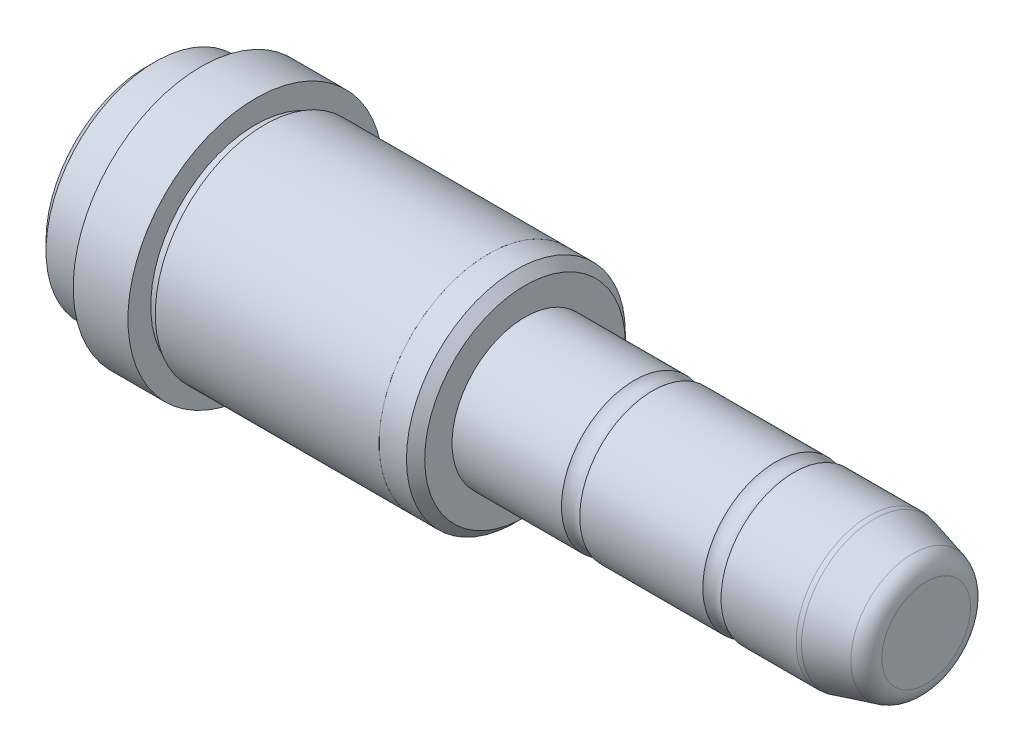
ISO-10303-21;
HEADER;
FILE_DESCRIPTION(('STEP AP214'),'2;1');
FILE_NAME('part.step','',(''),(''),'','','');
FILE_SCHEMA(('AUTOMOTIVE_DESIGN { 1 0 10303 214 1 1 1 1 }'));
ENDSEC;
DATA;
#1=APPLICATION_CONTEXT('core data for automotive mechanical design processes');
#2=APPLICATION_PROTOCOL_DEFINITION('international standard','automotive_design',2000,#1);
#3=PRODUCT_CONTEXT('',#1,'mechanical');
#4=PRODUCT('Part','Part','',(#3));
#5=PRODUCT_RELATED_PRODUCT_CATEGORY('part','',(#4));
#6=PRODUCT_DEFINITION_FORMATION('','',#4);
#7=PRODUCT_DEFINITION_CONTEXT('part definition',#1,'design');
#8=PRODUCT_DEFINITION('design','',#6,#7);
#9=PRODUCT_DEFINITION_SHAPE('','',#8);
#10=(LENGTH_UNIT() NAMED_UNIT(*) SI_UNIT(.MILLI.,.METRE.));
#11=(NAMED_UNIT(*) PLANE_ANGLE_UNIT() SI_UNIT($,.RADIAN.));
#12=(NAMED_UNIT(*) SI_UNIT($,.STERADIAN.) SOLID_ANGLE_UNIT());
#13=UNCERTAINTY_MEASURE_WITH_UNIT(LENGTH_MEASURE(1.E-05),#10,'distance_accuracy_value','');
#14=(GEOMETRIC_REPRESENTATION_CONTEXT(3) GLOBAL_UNCERTAINTY_ASSIGNED_CONTEXT((#13)) GLOBAL_UNIT_ASSIGNED_CONTEXT((#10,
#11,#12)) REPRESENTATION_CONTEXT('',''));
#15=CARTESIAN_POINT('',(0.,0.,0.));
#16=DIRECTION('',(0.,0.,1.));
#17=DIRECTION('',(1.,0.,0.));
#18=AXIS2_PLACEMENT_3D('',#15,#16,#17);
#19=CARTESIAN_POINT('',(85.55,2.42882543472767,0.));
#20=DIRECTION('',(1.,0.,0.));
#21=DIRECTION('',(0.,0.,-1.));
#22=AXIS2_PLACEMENT_3D('',#19,#20,#21);
#23=PLANE('',#22);
#24=CARTESIAN_POINT('',(85.55,0.,0.));
#25=DIRECTION('',(-1.,0.,0.));
#26=DIRECTION('',(0.,1.,0.));
#27=AXIS2_PLACEMENT_3D('',#24,#25,#26);
#28=CIRCLE('',#27,4.85765086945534);
#29=CARTESIAN_POINT('',(85.55,4.85765086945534,0.));
#30=VERTEX_POINT('',#29);
#31=EDGE_CURVE('E128',#30,#30,#28,.T.);
#32=ORIENTED_EDGE('',*,*,#31,.F.);
#33=EDGE_LOOP('',(#32));
#34=FACE_BOUND('',#33,.T.);
#35=ADVANCED_FACE('F15',(#34),#23,.T.);
#36=CARTESIAN_POINT('',(83.55,0.,0.));
#37=DIRECTION('',(1.,0.,0.));
#38=DIRECTION('',(0.,0.,-1.));
#39=AXIS2_PLACEMENT_3D('',#36,#37,#38);
#40=TOROIDAL_SURFACE('',#39,4.85765086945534,2.);
#41=CARTESIAN_POINT('',(84.0676380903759,0.,0.));
#42=DIRECTION('',(-1.,0.,0.));
#43=DIRECTION('',(0.,1.,0.));
#44=AXIS2_PLACEMENT_3D('',#41,#42,#43);
#45=CIRCLE('',#44,6.78950252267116);
#46=CARTESIAN_POINT('',(84.0676380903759,6.78950252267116,0.));
#47=VERTEX_POINT('',#46);
#48=EDGE_CURVE('E123',#47,#47,#45,.T.);
#49=ORIENTED_EDGE('',*,*,#48,.F.);
#50=EDGE_LOOP('',(#49));
#51=FACE_BOUND('',#50,.T.);
#52=ORIENTED_EDGE('',*,*,#31,.T.);
#53=EDGE_LOOP('',(#52));
#54=FACE_BOUND('',#53,.T.);
#55=ADVANCED_FACE('F135',(#51,#54),#40,.T.);
#56=CARTESIAN_POINT('',(79.8043330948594,0.,0.));
#57=DIRECTION('',(-1.,0.,0.));
#58=DIRECTION('',(0.,0.,1.));
#59=AXIS2_PLACEMENT_3D('',#56,#57,#58);
#60=CONICAL_SURFACE('',#59,7.93185165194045,0.261799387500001);
#61=CARTESIAN_POINT('',(79.8043330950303,0.,0.));
#62=DIRECTION('',(1.,0.,0.));
#63=DIRECTION('',(0.,0.,-1.));
#64=AXIS2_PLACEMENT_3D('',#61,#62,#63);
#65=CIRCLE('',#64,7.93185165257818);
#66=CARTESIAN_POINT('',(79.8043330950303,0.,-7.93185165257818));
#67=VERTEX_POINT('',#66);
#68=EDGE_CURVE('E119',#67,#67,#65,.F.);
#69=ORIENTED_EDGE('',*,*,#68,.F.);
#70=EDGE_LOOP('',(#69));
#71=FACE_BOUND('',#70,.T.);
#72=ORIENTED_EDGE('',*,*,#48,.T.);
#73=EDGE_LOOP('',(#72));
#74=FACE_BOUND('',#73,.T.);
#75=ADVANCED_FACE('F112',(#71,#74),#60,.T.);
#76=CARTESIAN_POINT('',(79.2866950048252,0.,0.));
#77=DIRECTION('',(1.,0.,0.));
#78=DIRECTION('',(0.,0.,-1.));
#79=AXIS2_PLACEMENT_3D('',#76,#77,#78);
#80=TOROIDAL_SURFACE('',#79,6.00000000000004,2.);
#81=CARTESIAN_POINT('',(79.2866950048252,0.,0.));
#82=DIRECTION('',(1.,0.,0.));
#83=DIRECTION('',(0.,0.,-1.));
#84=AXIS2_PLACEMENT_3D('',#81,#82,#83);
#85=CIRCLE('',#84,8.);
#86=CARTESIAN_POINT('',(79.2866950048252,0.,-8.));
#87=VERTEX_POINT('',#86);
#88=EDGE_CURVE('E122',#87,#87,#85,.F.);
#89=ORIENTED_EDGE('',*,*,#88,.F.);
#90=EDGE_LOOP('',(#89));
#91=FACE_BOUND('',#90,.T.);
#92=ORIENTED_EDGE('',*,*,#68,.T.);
#93=EDGE_LOOP('',(#92));
#94=FACE_BOUND('',#93,.T.);
#95=ADVANCED_FACE('F107',(#91,#94),#80,.T.);
#96=CARTESIAN_POINT('',(0.,5.492375,0.));
#97=DIRECTION('',(-1.,0.,0.));
#98=DIRECTION('',(0.,0.,1.));
#99=AXIS2_PLACEMENT_3D('',#96,#97,#98);
#100=PLANE('',#99);
#101=CARTESIAN_POINT('',(-4.48723089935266E-10,0.,0.));
#102=DIRECTION('',(1.,0.,0.));
#103=DIRECTION('',(0.,0.,-1.));
#104=AXIS2_PLACEMENT_3D('',#101,#102,#103);
#105=CIRCLE('',#104,10.9847500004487);
#106=CARTESIAN_POINT('',(-4.48723089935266E-10,0.,-10.9847500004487));
#107=VERTEX_POINT('',#106);
#108=EDGE_CURVE('E19',#107,#107,#105,.T.);
#109=ORIENTED_EDGE('',*,*,#108,.F.);
#110=EDGE_LOOP('',(#109));
#111=FACE_BOUND('',#110,.T.);
#112=ADVANCED_FACE('F103',(#111),#100,.T.);
#113=CARTESIAN_POINT('',(75.1683475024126,0.,0.));
#114=DIRECTION('',(1.,0.,0.));
#115=DIRECTION('',(0.,0.,-1.));
#116=AXIS2_PLACEMENT_3D('',#113,#114,#115);
#117=CYLINDRICAL_SURFACE('',#116,8.);
#118=CARTESIAN_POINT('',(71.05,0.,0.));
#119=DIRECTION('',(1.,0.,0.));
#120=DIRECTION('',(0.,0.,-1.));
#121=AXIS2_PLACEMENT_3D('',#118,#119,#120);
#122=CIRCLE('',#121,8.00000000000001);
#123=CARTESIAN_POINT('',(71.05,0.,-8.00000000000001));
#124=VERTEX_POINT('',#123);
#125=EDGE_CURVE('E76',#124,#124,#122,.T.);
#126=ORIENTED_EDGE('',*,*,#125,.T.);
#127=EDGE_LOOP('',(#126));
#128=FACE_BOUND('',#127,.T.);
#129=ORIENTED_EDGE('',*,*,#88,.T.);
#130=EDGE_LOOP('',(#129));
#131=FACE_BOUND('',#130,.T.);
#132=ADVANCED_FACE('F99',(#128,#131),#117,.T.);
#133=CARTESIAN_POINT('',(1.00000000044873,0.,0.));
#134=DIRECTION('',(1.,0.,0.));
#135=DIRECTION('',(0.,0.,-1.));
#136=AXIS2_PLACEMENT_3D('',#133,#134,#135);
#137=CONICAL_SURFACE('',#136,11.9847499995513,0.785398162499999);
#138=ORIENTED_EDGE('',*,*,#108,.T.);
#139=EDGE_LOOP('',(#138));
#140=FACE_BOUND('',#139,.T.);
#141=CARTESIAN_POINT('',(1.,0.,0.));
#142=DIRECTION('',(1.,0.,0.));
#143=DIRECTION('',(0.,0.,-1.));
#144=AXIS2_PLACEMENT_3D('',#141,#142,#143);
#145=CIRCLE('',#144,11.98475);
#146=CARTESIAN_POINT('',(1.,0.,-11.98475));
#147=VERTEX_POINT('',#146);
#148=EDGE_CURVE('E71',#147,#147,#145,.T.);
#149=ORIENTED_EDGE('',*,*,#148,.F.);
#150=EDGE_LOOP('',(#149));
#151=FACE_BOUND('',#150,.T.);
#152=ADVANCED_FACE('F94',(#140,#151),#137,.T.);
#153=CARTESIAN_POINT('',(70.05,0.,0.));
#154=DIRECTION('',(1.,0.,0.));
#155=DIRECTION('',(0.,0.,-1.));
#156=AXIS2_PLACEMENT_3D('',#153,#154,#155);
#157=TOROIDAL_SURFACE('',#156,9.11803398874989,1.5);
#158=CARTESIAN_POINT('',(69.05,0.,0.));
#159=DIRECTION('',(1.,0.,0.));
#160=DIRECTION('',(0.,0.,-1.));
#161=AXIS2_PLACEMENT_3D('',#158,#159,#160);
#162=CIRCLE('',#161,8.);
#163=CARTESIAN_POINT('',(69.05,0.,-8.));
#164=VERTEX_POINT('',#163);
#165=EDGE_CURVE('E65',#164,#164,#162,.F.);
#166=ORIENTED_EDGE('',*,*,#165,.F.);
#167=EDGE_LOOP('',(#166));
#168=FACE_BOUND('',#167,.T.);
#169=ORIENTED_EDGE('',*,*,#125,.F.);
#170=EDGE_LOOP('',(#169));
#171=FACE_BOUND('',#170,.T.);
#172=ADVANCED_FACE('F89',(#168,#171),#157,.F.);
#173=CARTESIAN_POINT('',(3.,0.,0.));
#174=DIRECTION('',(1.,0.,0.));
#175=DIRECTION('',(0.,0.,-1.));
#176=AXIS2_PLACEMENT_3D('',#173,#174,#175);
#177=CYLINDRICAL_SURFACE('',#176,11.98475);
#178=ORIENTED_EDGE('',*,*,#148,.T.);
#179=EDGE_LOOP('',(#178));
#180=FACE_BOUND('',#179,.T.);
#181=CARTESIAN_POINT('',(5.,0.,0.));
#182=DIRECTION('',(1.,0.,0.));
#183=DIRECTION('',(0.,0.,-1.));
#184=AXIS2_PLACEMENT_3D('',#181,#182,#183);
#185=CIRCLE('',#184,11.98475);
#186=CARTESIAN_POINT('',(5.,0.,-11.98475));
#187=VERTEX_POINT('',#186);
#188=EDGE_CURVE('E63',#187,#187,#185,.T.);
#189=ORIENTED_EDGE('',*,*,#188,.F.);
#190=EDGE_LOOP('',(#189));
#191=FACE_BOUND('',#190,.T.);
#192=ADVANCED_FACE('F93',(#180,#191),#177,.T.);
#193=CARTESIAN_POINT('',(62.3,0.,0.));
#194=DIRECTION('',(1.,0.,0.));
#195=DIRECTION('',(0.,0.,-1.));
#196=AXIS2_PLACEMENT_3D('',#193,#194,#195);
#197=CYLINDRICAL_SURFACE('',#196,8.);
#198=CARTESIAN_POINT('',(55.55,0.,0.));
#199=DIRECTION('',(1.,0.,0.));
#200=DIRECTION('',(0.,0.,-1.));
#201=AXIS2_PLACEMENT_3D('',#198,#199,#200);
#202=CIRCLE('',#201,8.);
#203=CARTESIAN_POINT('',(55.55,0.,-8.));
#204=VERTEX_POINT('',#203);
#205=EDGE_CURVE('E62',#204,#204,#202,.T.);
#206=ORIENTED_EDGE('',*,*,#205,.T.);
#207=EDGE_LOOP('',(#206));
#208=FACE_BOUND('',#207,.T.);
#209=ORIENTED_EDGE('',*,*,#165,.T.);
#210=EDGE_LOOP('',(#209));
#211=FACE_BOUND('',#210,.T.);
#212=ADVANCED_FACE('F224',(#208,#211),#197,.T.);
#213=CARTESIAN_POINT('',(5.,11.742375,0.));
#214=DIRECTION('',(1.,0.,0.));
#215=DIRECTION('',(0.,0.,-1.));
#216=AXIS2_PLACEMENT_3D('',#213,#214,#215);
#217=PLANE('',#216);
#218=CARTESIAN_POINT('',(5.,0.,0.));
#219=DIRECTION('',(1.,0.,0.));
#220=DIRECTION('',(0.,0.,-1.));
#221=AXIS2_PLACEMENT_3D('',#218,#219,#220);
#222=CIRCLE('',#221,11.5);
#223=CARTESIAN_POINT('',(5.,0.,-11.5));
#224=VERTEX_POINT('',#223);
#225=EDGE_CURVE('E60',#224,#224,#222,.T.);
#226=ORIENTED_EDGE('',*,*,#225,.F.);
#227=EDGE_LOOP('',(#226));
#228=FACE_BOUND('',#227,.T.);
#229=ORIENTED_EDGE('',*,*,#188,.T.);
#230=EDGE_LOOP('',(#229));
#231=FACE_BOUND('',#230,.T.);
#232=ADVANCED_FACE('F203',(#228,#231),#217,.T.);
#233=CARTESIAN_POINT('',(54.55,0.,0.));
#234=DIRECTION('',(1.,0.,0.));
#235=DIRECTION('',(0.,0.,-1.));
#236=AXIS2_PLACEMENT_3D('',#233,#234,#235);
#237=TOROIDAL_SURFACE('',#236,9.1180339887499,1.5);
#238=CARTESIAN_POINT('',(53.55,0.,0.));
#239=DIRECTION('',(1.,0.,0.));
#240=DIRECTION('',(0.,0.,-1.));
#241=AXIS2_PLACEMENT_3D('',#238,#239,#240);
#242=CIRCLE('',#241,8.);
#243=CARTESIAN_POINT('',(53.55,0.,-8.));
#244=VERTEX_POINT('',#243);
#245=EDGE_CURVE('E59',#244,#244,#242,.F.);
#246=ORIENTED_EDGE('',*,*,#245,.F.);
#247=EDGE_LOOP('',(#246));
#248=FACE_BOUND('',#247,.T.);
#249=ORIENTED_EDGE('',*,*,#205,.F.);
#250=EDGE_LOOP('',(#249));
#251=FACE_BOUND('',#250,.T.);
#252=ADVANCED_FACE('F198',(#248,#251),#237,.F.);
#253=CARTESIAN_POINT('',(5.5,0.,0.));
#254=DIRECTION('',(1.,0.,0.));
#255=DIRECTION('',(0.,0.,-1.));
#256=AXIS2_PLACEMENT_3D('',#253,#254,#255);
#257=CYLINDRICAL_SURFACE('',#256,11.5);
#258=ORIENTED_EDGE('',*,*,#225,.T.);
#259=EDGE_LOOP('',(#258));
#260=FACE_BOUND('',#259,.T.);
#261=CARTESIAN_POINT('',(6.,0.,0.));
#262=DIRECTION('',(1.,0.,0.));
#263=DIRECTION('',(0.,0.,-1.));
#264=AXIS2_PLACEMENT_3D('',#261,#262,#263);
#265=CIRCLE('',#264,11.5);
#266=CARTESIAN_POINT('',(6.,0.,-11.5));
#267=VERTEX_POINT('',#266);
#268=EDGE_CURVE('E56',#267,#267,#265,.T.);
#269=ORIENTED_EDGE('',*,*,#268,.F.);
#270=EDGE_LOOP('',(#269));
#271=FACE_BOUND('',#270,.T.);
#272=ADVANCED_FACE('F194',(#260,#271),#257,.T.);
#273=CARTESIAN_POINT('',(47.55,0.,0.));
#274=DIRECTION('',(1.,0.,0.));
#275=DIRECTION('',(0.,0.,-1.));
#276=AXIS2_PLACEMENT_3D('',#273,#274,#275);
#277=CYLINDRICAL_SURFACE('',#276,8.);
#278=CARTESIAN_POINT('',(41.55,0.,0.));
#279=DIRECTION('',(1.,0.,0.));
#280=DIRECTION('',(0.,0.,-1.));
#281=AXIS2_PLACEMENT_3D('',#278,#279,#280);
#282=CIRCLE('',#281,8.);
#283=CARTESIAN_POINT('',(41.55,0.,-8.));
#284=VERTEX_POINT('',#283);
#285=EDGE_CURVE('E53',#284,#284,#282,.F.);
#286=ORIENTED_EDGE('',*,*,#285,.F.);
#287=EDGE_LOOP('',(#286));
#288=FACE_BOUND('',#287,.T.);
#289=ORIENTED_EDGE('',*,*,#245,.T.);
#290=EDGE_LOOP('',(#289));
#291=FACE_BOUND('',#290,.T.);
#292=ADVANCED_FACE('F190',(#288,#291),#277,.T.);
#293=CARTESIAN_POINT('',(6.,12.75,0.));
#294=DIRECTION('',(-1.,0.,0.));
#295=DIRECTION('',(0.,0.,1.));
#296=AXIS2_PLACEMENT_3D('',#293,#294,#295);
#297=PLANE('',#296);
#298=ORIENTED_EDGE('',*,*,#268,.T.);
#299=EDGE_LOOP('',(#298));
#300=FACE_BOUND('',#299,.T.);
#301=CARTESIAN_POINT('',(6.,0.,0.));
#302=DIRECTION('',(1.,0.,0.));
#303=DIRECTION('',(0.,0.,-1.));
#304=AXIS2_PLACEMENT_3D('',#301,#302,#303);
#305=CIRCLE('',#304,14.);
#306=CARTESIAN_POINT('',(6.,0.,-14.));
#307=VERTEX_POINT('',#306);
#308=EDGE_CURVE('E50',#307,#307,#305,.T.);
#309=ORIENTED_EDGE('',*,*,#308,.F.);
#310=EDGE_LOOP('',(#309));
#311=FACE_BOUND('',#310,.T.);
#312=ADVANCED_FACE('F186',(#300,#311),#297,.T.);
#313=CARTESIAN_POINT('',(41.55,9.5,0.));
#314=DIRECTION('',(1.,0.,0.));
#315=DIRECTION('',(0.,0.,-1.));
#316=AXIS2_PLACEMENT_3D('',#313,#314,#315);
#317=PLANE('',#316);
#318=ORIENTED_EDGE('',*,*,#285,.T.);
#319=EDGE_LOOP('',(#318));
#320=FACE_BOUND('',#319,.T.);
#321=CARTESIAN_POINT('',(41.5500000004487,0.,0.));
#322=DIRECTION('',(-1.,0.,0.));
#323=DIRECTION('',(0.,0.,1.));
#324=AXIS2_PLACEMENT_3D('',#321,#322,#323);
#325=CIRCLE('',#324,11.0000000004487);
#326=CARTESIAN_POINT('',(41.5500000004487,0.,11.0000000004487));
#327=VERTEX_POINT('',#326);
#328=EDGE_CURVE('E47',#327,#327,#325,.T.);
#329=ORIENTED_EDGE('',*,*,#328,.F.);
#330=EDGE_LOOP('',(#329));
#331=FACE_BOUND('',#330,.T.);
#332=ADVANCED_FACE('F182',(#320,#331),#317,.T.);
#333=CARTESIAN_POINT('',(9.,0.,0.));
#334=DIRECTION('',(1.,0.,0.));
#335=DIRECTION('',(0.,0.,-1.));
#336=AXIS2_PLACEMENT_3D('',#333,#334,#335);
#337=CYLINDRICAL_SURFACE('',#336,14.);
#338=ORIENTED_EDGE('',*,*,#308,.T.);
#339=EDGE_LOOP('',(#338));
#340=FACE_BOUND('',#339,.T.);
#341=CARTESIAN_POINT('',(12.,0.,0.));
#342=DIRECTION('',(1.,0.,0.));
#343=DIRECTION('',(0.,0.,-1.));
#344=AXIS2_PLACEMENT_3D('',#341,#342,#343);
#345=CIRCLE('',#344,14.);
#346=CARTESIAN_POINT('',(12.,0.,-14.));
#347=VERTEX_POINT('',#346);
#348=EDGE_CURVE('E44',#347,#347,#345,.T.);
#349=ORIENTED_EDGE('',*,*,#348,.F.);
#350=EDGE_LOOP('',(#349));
#351=FACE_BOUND('',#350,.T.);
#352=ADVANCED_FACE('F178',(#340,#351),#337,.T.);
#353=CARTESIAN_POINT('',(40.5499999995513,0.,0.));
#354=DIRECTION('',(-1.,0.,0.));
#355=DIRECTION('',(0.,0.,1.));
#356=AXIS2_PLACEMENT_3D('',#353,#354,#355);
#357=CONICAL_SURFACE('',#356,11.9999999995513,0.785398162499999);
#358=CARTESIAN_POINT('',(40.55,0.,0.));
#359=DIRECTION('',(1.,0.,0.));
#360=DIRECTION('',(0.,0.,-1.));
#361=AXIS2_PLACEMENT_3D('',#358,#359,#360);
#362=CIRCLE('',#361,12.);
#363=CARTESIAN_POINT('',(40.55,0.,-12.));
#364=VERTEX_POINT('',#363);
#365=EDGE_CURVE('E43',#364,#364,#362,.F.);
#366=ORIENTED_EDGE('',*,*,#365,.F.);
#367=EDGE_LOOP('',(#366));
#368=FACE_BOUND('',#367,.T.);
#369=ORIENTED_EDGE('',*,*,#328,.T.);
#370=EDGE_LOOP('',(#369));
#371=FACE_BOUND('',#370,.T.);
#372=ADVANCED_FACE('F174',(#368,#371),#357,.T.);
#373=CARTESIAN_POINT('',(12.,12.75,0.));
#374=DIRECTION('',(1.,0.,0.));
#375=DIRECTION('',(0.,0.,-1.));
#376=AXIS2_PLACEMENT_3D('',#373,#374,#375);
#377=PLANE('',#376);
#378=CARTESIAN_POINT('',(12.,0.,0.));
#379=DIRECTION('',(1.,0.,0.));
#380=DIRECTION('',(0.,0.,-1.));
#381=AXIS2_PLACEMENT_3D('',#378,#379,#380);
#382=CIRCLE('',#381,11.5);
#383=CARTESIAN_POINT('',(12.,0.,-11.5));
#384=VERTEX_POINT('',#383);
#385=EDGE_CURVE('E40',#384,#384,#382,.T.);
#386=ORIENTED_EDGE('',*,*,#385,.F.);
#387=EDGE_LOOP('',(#386));
#388=FACE_BOUND('',#387,.T.);
#389=ORIENTED_EDGE('',*,*,#348,.T.);
#390=EDGE_LOOP('',(#389));
#391=FACE_BOUND('',#390,.T.);
#392=ADVANCED_FACE('F170',(#388,#391),#377,.T.);
#393=CARTESIAN_POINT('',(39.05,0.,0.));
#394=DIRECTION('',(1.,0.,0.));
#395=DIRECTION('',(0.,0.,-1.));
#396=AXIS2_PLACEMENT_3D('',#393,#394,#395);
#397=CYLINDRICAL_SURFACE('',#396,12.);
#398=CARTESIAN_POINT('',(37.55,0.,0.));
#399=DIRECTION('',(1.,0.,0.));
#400=DIRECTION('',(0.,0.,-1.));
#401=AXIS2_PLACEMENT_3D('',#398,#399,#400);
#402=CIRCLE('',#401,12.);
#403=CARTESIAN_POINT('',(37.55,0.,-12.));
#404=VERTEX_POINT('',#403);
#405=EDGE_CURVE('E37',#404,#404,#402,.F.);
#406=ORIENTED_EDGE('',*,*,#405,.F.);
#407=EDGE_LOOP('',(#406));
#408=FACE_BOUND('',#407,.T.);
#409=ORIENTED_EDGE('',*,*,#365,.T.);
#410=EDGE_LOOP('',(#409));
#411=FACE_BOUND('',#410,.T.);
#412=ADVANCED_FACE('F166',(#408,#411),#397,.T.);
#413=CARTESIAN_POINT('',(12.5,0.,0.));
#414=DIRECTION('',(1.,0.,0.));
#415=DIRECTION('',(0.,0.,-1.));
#416=AXIS2_PLACEMENT_3D('',#413,#414,#415);
#417=CYLINDRICAL_SURFACE('',#416,11.5);
#418=ORIENTED_EDGE('',*,*,#385,.T.);
#419=EDGE_LOOP('',(#418));
#420=FACE_BOUND('',#419,.T.);
#421=CARTESIAN_POINT('',(13.,0.,0.));
#422=DIRECTION('',(1.,0.,0.));
#423=DIRECTION('',(0.,0.,-1.));
#424=AXIS2_PLACEMENT_3D('',#421,#422,#423);
#425=CIRCLE('',#424,11.5);
#426=CARTESIAN_POINT('',(13.,0.,-11.5));
#427=VERTEX_POINT('',#426);
#428=EDGE_CURVE('E28',#427,#427,#425,.T.);
#429=ORIENTED_EDGE('',*,*,#428,.F.);
#430=EDGE_LOOP('',(#429));
#431=FACE_BOUND('',#430,.T.);
#432=ADVANCED_FACE('F162',(#420,#431),#417,.T.);
#433=CARTESIAN_POINT('',(37.55,12.002125,0.));
#434=DIRECTION('',(1.,0.,0.));
#435=DIRECTION('',(0.,0.,-1.));
#436=AXIS2_PLACEMENT_3D('',#433,#434,#435);
#437=PLANE('',#436);
#438=ORIENTED_EDGE('',*,*,#405,.T.);
#439=EDGE_LOOP('',(#438));
#440=FACE_BOUND('',#439,.T.);
#441=CARTESIAN_POINT('',(37.55,0.,0.));
#442=DIRECTION('',(1.,0.,0.));
#443=DIRECTION('',(0.,0.,-1.));
#444=AXIS2_PLACEMENT_3D('',#441,#442,#443);
#445=CIRCLE('',#444,12.00425);
#446=CARTESIAN_POINT('',(37.55,0.,-12.00425));
#447=VERTEX_POINT('',#446);
#448=EDGE_CURVE('E23',#447,#447,#445,.F.);
#449=ORIENTED_EDGE('',*,*,#448,.F.);
#450=EDGE_LOOP('',(#449));
#451=FACE_BOUND('',#450,.T.);
#452=ADVANCED_FACE('F155',(#440,#451),#437,.T.);
#453=CARTESIAN_POINT('',(13.,11.752125,0.));
#454=DIRECTION('',(-1.,0.,0.));
#455=DIRECTION('',(0.,0.,1.));
#456=AXIS2_PLACEMENT_3D('',#453,#454,#455);
#457=PLANE('',#456);
#458=ORIENTED_EDGE('',*,*,#428,.T.);
#459=EDGE_LOOP('',(#458));
#460=FACE_BOUND('',#459,.T.);
#461=CARTESIAN_POINT('',(13.,0.,0.));
#462=DIRECTION('',(1.,0.,0.));
#463=DIRECTION('',(0.,0.,-1.));
#464=AXIS2_PLACEMENT_3D('',#461,#462,#463);
#465=CIRCLE('',#464,12.00425);
#466=CARTESIAN_POINT('',(13.,0.,-12.00425));
#467=VERTEX_POINT('',#466);
#468=EDGE_CURVE('E10',#467,#467,#465,.T.);
#469=ORIENTED_EDGE('',*,*,#468,.F.);
#470=EDGE_LOOP('',(#469));
#471=FACE_BOUND('',#470,.T.);
#472=ADVANCED_FACE('F150',(#460,#471),#457,.T.);
#473=CARTESIAN_POINT('',(25.275,0.,0.));
#474=DIRECTION('',(1.,0.,0.));
#475=DIRECTION('',(0.,0.,-1.));
#476=AXIS2_PLACEMENT_3D('',#473,#474,#475);
#477=CYLINDRICAL_SURFACE('',#476,12.00425);
#478=ORIENTED_EDGE('',*,*,#468,.T.);
#479=EDGE_LOOP('',(#478));
#480=FACE_BOUND('',#479,.T.);
#481=ORIENTED_EDGE('',*,*,#448,.T.);
#482=EDGE_LOOP('',(#481));
#483=FACE_BOUND('',#482,.T.);
#484=ADVANCED_FACE('F148',(#480,#483),#477,.T.);
#485=CLOSED_SHELL('',(#35,#55,#75,#95,#112,#132,#152,#172,#192,#212,#232,#252,#272,#292,#312,
#332,#352,#372,#392,#412,#432,#452,#472,#484));
#486=MANIFOLD_SOLID_BREP('B1',#485);
#487=ADVANCED_BREP_SHAPE_REPRESENTATION('',(#18,#486),#14);
#488=SHAPE_DEFINITION_REPRESENTATION(#9,#487);
ENDSEC;
END-ISO-10303-21;
